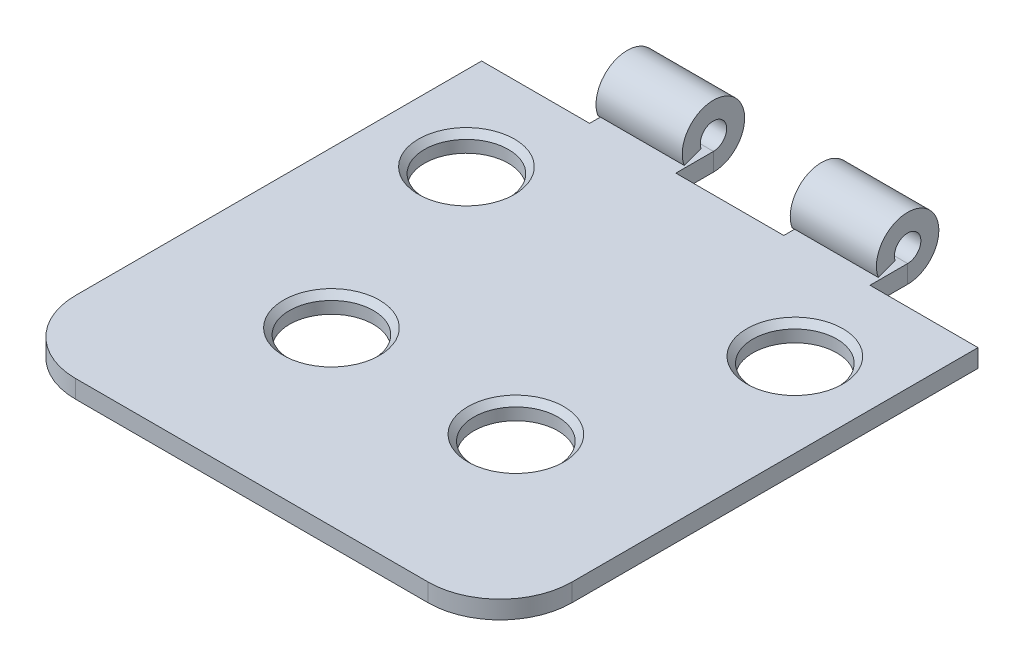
ISO-10303-21;
HEADER;
FILE_DESCRIPTION(('STEP AP214'),'2;1');
FILE_NAME('part.step','',(''),(''),'','','');
FILE_SCHEMA(('AUTOMOTIVE_DESIGN { 1 0 10303 214 1 1 1 1 }'));
ENDSEC;
DATA;
#1=APPLICATION_CONTEXT('core data for automotive mechanical design processes');
#2=APPLICATION_PROTOCOL_DEFINITION('international standard','automotive_design',2000,#1);
#3=PRODUCT_CONTEXT('',#1,'mechanical');
#4=PRODUCT('Part','Part','',(#3));
#5=PRODUCT_RELATED_PRODUCT_CATEGORY('part','',(#4));
#6=PRODUCT_DEFINITION_FORMATION('','',#4);
#7=PRODUCT_DEFINITION_CONTEXT('part definition',#1,'design');
#8=PRODUCT_DEFINITION('design','',#6,#7);
#9=PRODUCT_DEFINITION_SHAPE('','',#8);
#10=(LENGTH_UNIT() NAMED_UNIT(*) SI_UNIT(.MILLI.,.METRE.));
#11=(NAMED_UNIT(*) PLANE_ANGLE_UNIT() SI_UNIT($,.RADIAN.));
#12=(NAMED_UNIT(*) SI_UNIT($,.STERADIAN.) SOLID_ANGLE_UNIT());
#13=UNCERTAINTY_MEASURE_WITH_UNIT(LENGTH_MEASURE(1.E-05),#10,'distance_accuracy_value','');
#14=(GEOMETRIC_REPRESENTATION_CONTEXT(3) GLOBAL_UNCERTAINTY_ASSIGNED_CONTEXT((#13)) GLOBAL_UNIT_ASSIGNED_CONTEXT((#10,
#11,#12)) REPRESENTATION_CONTEXT('',''));
#15=CARTESIAN_POINT('',(0.,0.,0.));
#16=DIRECTION('',(0.,0.,1.));
#17=DIRECTION('',(1.,0.,0.));
#18=AXIS2_PLACEMENT_3D('',#15,#16,#17);
#19=CARTESIAN_POINT('',(9.57949999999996,-0.521709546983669,-5.99830888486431));
#20=DIRECTION('',(0.,1.,0.));
#21=DIRECTION('',(0.,0.,1.));
#22=AXIS2_PLACEMENT_3D('',#19,#20,#21);
#23=CONICAL_SURFACE('',#22,2.45,0.785398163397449);
#24=CARTESIAN_POINT('',(9.57949999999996,-0.171709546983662,-5.99830888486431));
#25=DIRECTION('',(0.,-1.,0.));
#26=DIRECTION('',(0.,0.,-1.));
#27=AXIS2_PLACEMENT_3D('',#24,#25,#26);
#28=CIRCLE('',#27,2.80000000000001);
#29=CARTESIAN_POINT('',(9.57949999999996,-0.171709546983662,-8.79830888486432));
#30=VERTEX_POINT('',#29);
#31=EDGE_CURVE('E276',#30,#30,#28,.T.);
#32=ORIENTED_EDGE('',*,*,#31,.F.);
#33=EDGE_LOOP('',(#32));
#34=FACE_BOUND('',#33,.T.);
#35=CARTESIAN_POINT('',(9.57949999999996,-0.521709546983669,-5.99830888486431));
#36=DIRECTION('',(0.,-1.,0.));
#37=DIRECTION('',(0.,0.,-1.));
#38=AXIS2_PLACEMENT_3D('',#35,#36,#37);
#39=CIRCLE('',#38,2.45);
#40=CARTESIAN_POINT('',(9.57949999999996,-0.521709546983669,-8.44830888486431));
#41=VERTEX_POINT('',#40);
#42=EDGE_CURVE('E354',#41,#41,#39,.F.);
#43=ORIENTED_EDGE('',*,*,#42,.F.);
#44=EDGE_LOOP('',(#43));
#45=FACE_BOUND('',#44,.T.);
#46=ADVANCED_FACE('F54',(#34,#45),#23,.F.);
#47=CARTESIAN_POINT('',(5.37949999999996,-0.521709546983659,6.07683324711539));
#48=DIRECTION('',(0.,1.,0.));
#49=DIRECTION('',(0.,0.,1.));
#50=AXIS2_PLACEMENT_3D('',#47,#48,#49);
#51=CONICAL_SURFACE('',#50,2.45,0.78539816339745);
#52=CARTESIAN_POINT('',(5.37949999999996,-0.171709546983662,6.07683324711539));
#53=DIRECTION('',(0.,-1.,0.));
#54=DIRECTION('',(0.,0.,-1.));
#55=AXIS2_PLACEMENT_3D('',#52,#53,#54);
#56=CIRCLE('',#55,2.8);
#57=CARTESIAN_POINT('',(5.37949999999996,-0.171709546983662,3.27683324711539));
#58=VERTEX_POINT('',#57);
#59=EDGE_CURVE('E279',#58,#58,#56,.T.);
#60=ORIENTED_EDGE('',*,*,#59,.F.);
#61=EDGE_LOOP('',(#60));
#62=FACE_BOUND('',#61,.T.);
#63=CARTESIAN_POINT('',(5.37949999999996,-0.521709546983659,6.07683324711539));
#64=DIRECTION('',(0.,-1.,0.));
#65=DIRECTION('',(0.,0.,-1.));
#66=AXIS2_PLACEMENT_3D('',#63,#64,#65);
#67=CIRCLE('',#66,2.45);
#68=CARTESIAN_POINT('',(5.37949999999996,-0.521709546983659,3.62683324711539));
#69=VERTEX_POINT('',#68);
#70=EDGE_CURVE('E357',#69,#69,#67,.F.);
#71=ORIENTED_EDGE('',*,*,#70,.F.);
#72=EDGE_LOOP('',(#71));
#73=FACE_BOUND('',#72,.T.);
#74=ADVANCED_FACE('F418',(#62,#73),#51,.F.);
#75=CARTESIAN_POINT('',(-5.37950000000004,-0.521709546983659,6.07683324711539));
#76=DIRECTION('',(0.,1.,0.));
#77=DIRECTION('',(0.,0.,1.));
#78=AXIS2_PLACEMENT_3D('',#75,#76,#77);
#79=CONICAL_SURFACE('',#78,2.45,0.78539816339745);
#80=CARTESIAN_POINT('',(-5.37950000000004,-0.171709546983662,6.07683324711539));
#81=DIRECTION('',(0.,-1.,0.));
#82=DIRECTION('',(0.,0.,-1.));
#83=AXIS2_PLACEMENT_3D('',#80,#81,#82);
#84=CIRCLE('',#83,2.8);
#85=CARTESIAN_POINT('',(-5.37950000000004,-0.171709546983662,3.27683324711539));
#86=VERTEX_POINT('',#85);
#87=EDGE_CURVE('E282',#86,#86,#84,.T.);
#88=ORIENTED_EDGE('',*,*,#87,.F.);
#89=EDGE_LOOP('',(#88));
#90=FACE_BOUND('',#89,.T.);
#91=CARTESIAN_POINT('',(-5.37950000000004,-0.521709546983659,6.07683324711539));
#92=DIRECTION('',(0.,-1.,0.));
#93=DIRECTION('',(0.,0.,-1.));
#94=AXIS2_PLACEMENT_3D('',#91,#92,#93);
#95=CIRCLE('',#94,2.45);
#96=CARTESIAN_POINT('',(-5.37950000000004,-0.521709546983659,3.62683324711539));
#97=VERTEX_POINT('',#96);
#98=EDGE_CURVE('E360',#97,#97,#95,.F.);
#99=ORIENTED_EDGE('',*,*,#98,.F.);
#100=EDGE_LOOP('',(#99));
#101=FACE_BOUND('',#100,.T.);
#102=ADVANCED_FACE('F424',(#90,#101),#79,.F.);
#103=CARTESIAN_POINT('',(-9.57950000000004,-0.521709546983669,-5.99830888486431));
#104=DIRECTION('',(0.,1.,0.));
#105=DIRECTION('',(0.,0.,1.));
#106=AXIS2_PLACEMENT_3D('',#103,#104,#105);
#107=CONICAL_SURFACE('',#106,2.45,0.785398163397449);
#108=CARTESIAN_POINT('',(-9.57950000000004,-0.171709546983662,-5.99830888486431));
#109=DIRECTION('',(0.,-1.,0.));
#110=DIRECTION('',(0.,0.,-1.));
#111=AXIS2_PLACEMENT_3D('',#108,#109,#110);
#112=CIRCLE('',#111,2.80000000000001);
#113=CARTESIAN_POINT('',(-9.57950000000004,-0.171709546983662,-8.79830888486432));
#114=VERTEX_POINT('',#113);
#115=EDGE_CURVE('E285',#114,#114,#112,.T.);
#116=ORIENTED_EDGE('',*,*,#115,.F.);
#117=EDGE_LOOP('',(#116));
#118=FACE_BOUND('',#117,.T.);
#119=CARTESIAN_POINT('',(-9.57950000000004,-0.521709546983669,-5.99830888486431));
#120=DIRECTION('',(0.,-1.,0.));
#121=DIRECTION('',(0.,0.,-1.));
#122=AXIS2_PLACEMENT_3D('',#119,#120,#121);
#123=CIRCLE('',#122,2.45);
#124=CARTESIAN_POINT('',(-9.57950000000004,-0.521709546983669,-8.44830888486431));
#125=VERTEX_POINT('',#124);
#126=EDGE_CURVE('E363',#125,#125,#123,.F.);
#127=ORIENTED_EDGE('',*,*,#126,.F.);
#128=EDGE_LOOP('',(#127));
#129=FACE_BOUND('',#128,.T.);
#130=ADVANCED_FACE('F434',(#118,#129),#107,.F.);
#131=CARTESIAN_POINT('',(-9.57950000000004,-1.22170954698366,-5.99830888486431));
#132=DIRECTION('',(0.,1.,0.));
#133=DIRECTION('',(0.,0.,1.));
#134=AXIS2_PLACEMENT_3D('',#131,#132,#133);
#135=CYLINDRICAL_SURFACE('',#134,2.45);
#136=ORIENTED_EDGE('',*,*,#126,.T.);
#137=EDGE_LOOP('',(#136));
#138=FACE_BOUND('',#137,.T.);
#139=CARTESIAN_POINT('',(-9.57950000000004,-1.22170954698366,-5.99830888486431));
#140=DIRECTION('',(0.,1.,0.));
#141=DIRECTION('',(0.,0.,1.));
#142=AXIS2_PLACEMENT_3D('',#139,#140,#141);
#143=CIRCLE('',#142,2.45);
#144=CARTESIAN_POINT('',(-9.57950000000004,-1.22170954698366,-3.54830888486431));
#145=VERTEX_POINT('',#144);
#146=EDGE_CURVE('E294',#145,#145,#143,.T.);
#147=ORIENTED_EDGE('',*,*,#146,.F.);
#148=EDGE_LOOP('',(#147));
#149=FACE_BOUND('',#148,.T.);
#150=ADVANCED_FACE('F438',(#138,#149),#135,.F.);
#151=CARTESIAN_POINT('',(-5.37950000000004,-1.22170954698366,6.07683324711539));
#152=DIRECTION('',(0.,1.,0.));
#153=DIRECTION('',(0.,0.,1.));
#154=AXIS2_PLACEMENT_3D('',#151,#152,#153);
#155=CYLINDRICAL_SURFACE('',#154,2.45);
#156=ORIENTED_EDGE('',*,*,#98,.T.);
#157=EDGE_LOOP('',(#156));
#158=FACE_BOUND('',#157,.T.);
#159=CARTESIAN_POINT('',(-5.37950000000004,-1.22170954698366,6.07683324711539));
#160=DIRECTION('',(0.,1.,0.));
#161=DIRECTION('',(0.,0.,1.));
#162=AXIS2_PLACEMENT_3D('',#159,#160,#161);
#163=CIRCLE('',#162,2.45);
#164=CARTESIAN_POINT('',(-5.37950000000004,-1.22170954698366,8.52683324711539));
#165=VERTEX_POINT('',#164);
#166=EDGE_CURVE('E297',#165,#165,#163,.T.);
#167=ORIENTED_EDGE('',*,*,#166,.F.);
#168=EDGE_LOOP('',(#167));
#169=FACE_BOUND('',#168,.T.);
#170=ADVANCED_FACE('F442',(#158,#169),#155,.F.);
#171=CARTESIAN_POINT('',(5.37949999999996,-1.22170954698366,6.07683324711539));
#172=DIRECTION('',(0.,1.,0.));
#173=DIRECTION('',(0.,0.,1.));
#174=AXIS2_PLACEMENT_3D('',#171,#172,#173);
#175=CYLINDRICAL_SURFACE('',#174,2.45);
#176=ORIENTED_EDGE('',*,*,#70,.T.);
#177=EDGE_LOOP('',(#176));
#178=FACE_BOUND('',#177,.T.);
#179=CARTESIAN_POINT('',(5.37949999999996,-1.22170954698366,6.07683324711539));
#180=DIRECTION('',(0.,1.,0.));
#181=DIRECTION('',(0.,0.,-1.));
#182=AXIS2_PLACEMENT_3D('',#179,#180,#181);
#183=CIRCLE('',#182,2.45);
#184=CARTESIAN_POINT('',(5.37949999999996,-1.22170954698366,3.62683324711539));
#185=VERTEX_POINT('',#184);
#186=EDGE_CURVE('E300',#185,#185,#183,.T.);
#187=ORIENTED_EDGE('',*,*,#186,.F.);
#188=EDGE_LOOP('',(#187));
#189=FACE_BOUND('',#188,.T.);
#190=ADVANCED_FACE('F446',(#178,#189),#175,.F.);
#191=CARTESIAN_POINT('',(9.57949999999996,-1.22170954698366,-5.99830888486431));
#192=DIRECTION('',(0.,1.,0.));
#193=DIRECTION('',(0.,0.,1.));
#194=AXIS2_PLACEMENT_3D('',#191,#192,#193);
#195=CYLINDRICAL_SURFACE('',#194,2.45);
#196=ORIENTED_EDGE('',*,*,#42,.T.);
#197=EDGE_LOOP('',(#196));
#198=FACE_BOUND('',#197,.T.);
#199=CARTESIAN_POINT('',(9.57949999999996,-1.22170954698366,-5.99830888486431));
#200=DIRECTION('',(0.,1.,0.));
#201=DIRECTION('',(0.,0.,-1.));
#202=AXIS2_PLACEMENT_3D('',#199,#200,#201);
#203=CIRCLE('',#202,2.45);
#204=CARTESIAN_POINT('',(9.57949999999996,-1.22170954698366,-8.44830888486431));
#205=VERTEX_POINT('',#204);
#206=EDGE_CURVE('E303',#205,#205,#203,.T.);
#207=ORIENTED_EDGE('',*,*,#206,.F.);
#208=EDGE_LOOP('',(#207));
#209=FACE_BOUND('',#208,.T.);
#210=ADVANCED_FACE('F450',(#198,#209),#195,.F.);
#211=CARTESIAN_POINT('',(-3.15000000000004,-3.67170954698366,-11.7828928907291));
#212=DIRECTION('',(0.,0.,1.));
#213=DIRECTION('',(1.,0.,0.));
#214=AXIS2_PLACEMENT_3D('',#211,#212,#213);
#215=PLANE('',#214);
#216=DIRECTION('',(-1.,0.,0.));
#217=VECTOR('',#216,1.);
#218=CARTESIAN_POINT('',(-10.2795000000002,-1.22170954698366,-11.7828928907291));
#219=LINE('',#218,#217);
#220=CARTESIAN_POINT('',(3.14999999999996,-1.22170954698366,-11.7828928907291));
#221=VERTEX_POINT('',#220);
#222=CARTESIAN_POINT('',(-3.15000000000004,-1.22170954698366,-11.7828928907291));
#223=VERTEX_POINT('',#222);
#224=EDGE_CURVE('E352',#221,#223,#219,.T.);
#225=ORIENTED_EDGE('',*,*,#224,.T.);
#226=DIRECTION('',(0.,1.,0.));
#227=VECTOR('',#226,1.);
#228=CARTESIAN_POINT('',(-3.15000000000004,-3.67170954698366,-11.7828928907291));
#229=LINE('',#228,#227);
#230=CARTESIAN_POINT('',(-3.15000000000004,-0.171709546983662,-11.7828928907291));
#231=VERTEX_POINT('',#230);
#232=EDGE_CURVE('E350',#223,#231,#229,.T.);
#233=ORIENTED_EDGE('',*,*,#232,.T.);
#234=DIRECTION('',(1.,0.,0.));
#235=VECTOR('',#234,1.);
#236=CARTESIAN_POINT('',(-3.15000000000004,-0.171709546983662,-11.7828928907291));
#237=LINE('',#236,#235);
#238=CARTESIAN_POINT('',(3.14999999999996,-0.171709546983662,-11.7828928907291));
#239=VERTEX_POINT('',#238);
#240=EDGE_CURVE('E347',#231,#239,#237,.T.);
#241=ORIENTED_EDGE('',*,*,#240,.T.);
#242=DIRECTION('',(0.,1.,0.));
#243=VECTOR('',#242,1.);
#244=CARTESIAN_POINT('',(3.14999999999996,-3.67170954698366,-11.7828928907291));
#245=LINE('',#244,#243);
#246=EDGE_CURVE('E258',#221,#239,#245,.T.);
#247=ORIENTED_EDGE('',*,*,#246,.F.);
#248=EDGE_LOOP('',(#225,#233,#241,#247));
#249=FACE_BOUND('',#248,.T.);
#250=ADVANCED_FACE('F400',(#249),#215,.F.);
#251=CARTESIAN_POINT('',(-8.17950000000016,-3.67170954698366,-11.7828928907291));
#252=DIRECTION('',(0.,0.,1.));
#253=DIRECTION('',(1.,0.,0.));
#254=AXIS2_PLACEMENT_3D('',#251,#252,#253);
#255=PLANE('',#254);
#256=DIRECTION('',(-1.,0.,0.));
#257=VECTOR('',#256,1.);
#258=CARTESIAN_POINT('',(-10.2795000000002,-1.22170954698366,-11.7828928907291));
#259=LINE('',#258,#257);
#260=CARTESIAN_POINT('',(-8.17950000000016,-1.22170954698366,-11.7828928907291));
#261=VERTEX_POINT('',#260);
#262=CARTESIAN_POINT('',(-14.4795000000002,-1.22170954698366,-11.7828928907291));
#263=VERTEX_POINT('',#262);
#264=EDGE_CURVE('E345',#261,#263,#259,.T.);
#265=ORIENTED_EDGE('',*,*,#264,.T.);
#266=DIRECTION('',(0.,1.,0.));
#267=VECTOR('',#266,1.);
#268=CARTESIAN_POINT('',(-14.4795000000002,-3.67170954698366,-11.7828928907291));
#269=LINE('',#268,#267);
#270=CARTESIAN_POINT('',(-14.4795000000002,-0.171709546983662,-11.7828928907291));
#271=VERTEX_POINT('',#270);
#272=EDGE_CURVE('E343',#263,#271,#269,.T.);
#273=ORIENTED_EDGE('',*,*,#272,.T.);
#274=DIRECTION('',(1.,0.,0.));
#275=VECTOR('',#274,1.);
#276=CARTESIAN_POINT('',(-8.17950000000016,-0.171709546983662,-11.7828928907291));
#277=LINE('',#276,#275);
#278=CARTESIAN_POINT('',(-8.17950000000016,-0.171709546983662,-11.7828928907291));
#279=VERTEX_POINT('',#278);
#280=EDGE_CURVE('E341',#271,#279,#277,.T.);
#281=ORIENTED_EDGE('',*,*,#280,.T.);
#282=DIRECTION('',(0.,1.,0.));
#283=VECTOR('',#282,1.);
#284=CARTESIAN_POINT('',(-8.17950000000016,-3.67170954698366,-11.7828928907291));
#285=LINE('',#284,#283);
#286=EDGE_CURVE('E64',#261,#279,#285,.T.);
#287=ORIENTED_EDGE('',*,*,#286,.F.);
#288=EDGE_LOOP('',(#265,#273,#281,#287));
#289=FACE_BOUND('',#288,.T.);
#290=ADVANCED_FACE('F457',(#289),#255,.F.);
#291=CARTESIAN_POINT('',(-14.4795000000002,-1.22170954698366,11.9006911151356));
#292=DIRECTION('',(-1.,0.,0.));
#293=DIRECTION('',(0.,0.,1.));
#294=AXIS2_PLACEMENT_3D('',#291,#292,#293);
#295=PLANE('',#294);
#296=ORIENTED_EDGE('',*,*,#272,.F.);
#297=DIRECTION('',(0.,0.,1.));
#298=VECTOR('',#297,1.);
#299=CARTESIAN_POINT('',(-14.4795000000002,-1.22170954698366,11.9006911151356));
#300=LINE('',#299,#298);
#301=CARTESIAN_POINT('',(-14.4795000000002,-1.22170954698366,11.9006911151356));
#302=VERTEX_POINT('',#301);
#303=EDGE_CURVE('E339',#263,#302,#300,.T.);
#304=ORIENTED_EDGE('',*,*,#303,.T.);
#305=DIRECTION('',(0.,1.,0.));
#306=VECTOR('',#305,1.);
#307=CARTESIAN_POINT('',(-14.4795000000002,-1.22170954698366,11.9006911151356));
#308=LINE('',#307,#306);
#309=CARTESIAN_POINT('',(-14.4795000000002,-0.171709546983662,11.9006911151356));
#310=VERTEX_POINT('',#309);
#311=EDGE_CURVE('E336',#302,#310,#308,.T.);
#312=ORIENTED_EDGE('',*,*,#311,.T.);
#313=DIRECTION('',(0.,0.,1.));
#314=VECTOR('',#313,1.);
#315=CARTESIAN_POINT('',(-14.4795000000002,-0.171709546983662,11.9006911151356));
#316=LINE('',#315,#314);
#317=EDGE_CURVE('E271',#271,#310,#316,.T.);
#318=ORIENTED_EDGE('',*,*,#317,.F.);
#319=EDGE_LOOP('',(#296,#304,#312,#318));
#320=FACE_BOUND('',#319,.T.);
#321=ADVANCED_FACE('F460',(#320),#295,.T.);
#322=CARTESIAN_POINT('',(-10.2795000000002,-1.22170954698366,11.9006911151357));
#323=DIRECTION('',(0.,1.,0.));
#324=DIRECTION('',(0.,0.,1.));
#325=AXIS2_PLACEMENT_3D('',#322,#323,#324);
#326=CYLINDRICAL_SURFACE('',#325,4.2);
#327=CARTESIAN_POINT('',(-10.2795000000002,-0.171709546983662,11.9006911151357));
#328=DIRECTION('',(0.,1.,0.));
#329=DIRECTION('',(0.,0.,-1.));
#330=AXIS2_PLACEMENT_3D('',#327,#328,#329);
#331=CIRCLE('',#330,4.2);
#332=CARTESIAN_POINT('',(-10.2795000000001,-0.171709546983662,16.1006911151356));
#333=VERTEX_POINT('',#332);
#334=EDGE_CURVE('E268',#310,#333,#331,.T.);
#335=ORIENTED_EDGE('',*,*,#334,.F.);
#336=ORIENTED_EDGE('',*,*,#311,.F.);
#337=CARTESIAN_POINT('',(-10.2795000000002,-1.22170954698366,11.9006911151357));
#338=DIRECTION('',(0.,1.,0.));
#339=DIRECTION('',(0.,0.,-1.));
#340=AXIS2_PLACEMENT_3D('',#337,#338,#339);
#341=CIRCLE('',#340,4.2);
#342=CARTESIAN_POINT('',(-10.2795000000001,-1.22170954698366,16.1006911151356));
#343=VERTEX_POINT('',#342);
#344=EDGE_CURVE('E333',#302,#343,#341,.T.);
#345=ORIENTED_EDGE('',*,*,#344,.T.);
#346=DIRECTION('',(0.,1.,0.));
#347=VECTOR('',#346,1.);
#348=CARTESIAN_POINT('',(-10.2795000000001,-1.22170954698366,16.1006911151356));
#349=LINE('',#348,#347);
#350=EDGE_CURVE('E331',#343,#333,#349,.T.);
#351=ORIENTED_EDGE('',*,*,#350,.T.);
#352=EDGE_LOOP('',(#335,#336,#345,#351));
#353=FACE_BOUND('',#352,.T.);
#354=ADVANCED_FACE('F464',(#353),#326,.T.);
#355=CARTESIAN_POINT('',(-10.2795000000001,-1.22170954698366,16.1006911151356));
#356=DIRECTION('',(0.,0.,1.));
#357=DIRECTION('',(1.,0.,0.));
#358=AXIS2_PLACEMENT_3D('',#355,#356,#357);
#359=PLANE('',#358);
#360=DIRECTION('',(1.,0.,0.));
#361=VECTOR('',#360,1.);
#362=CARTESIAN_POINT('',(-10.2795000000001,-0.171709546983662,16.1006911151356));
#363=LINE('',#362,#361);
#364=CARTESIAN_POINT('',(10.2794999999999,-0.171709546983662,16.1006911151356));
#365=VERTEX_POINT('',#364);
#366=EDGE_CURVE('E265',#333,#365,#363,.T.);
#367=ORIENTED_EDGE('',*,*,#366,.F.);
#368=ORIENTED_EDGE('',*,*,#350,.F.);
#369=DIRECTION('',(1.,0.,0.));
#370=VECTOR('',#369,1.);
#371=CARTESIAN_POINT('',(-10.2795000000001,-1.22170954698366,16.1006911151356));
#372=LINE('',#371,#370);
#373=CARTESIAN_POINT('',(10.2794999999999,-1.22170954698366,16.1006911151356));
#374=VERTEX_POINT('',#373);
#375=EDGE_CURVE('E328',#343,#374,#372,.T.);
#376=ORIENTED_EDGE('',*,*,#375,.T.);
#377=DIRECTION('',(0.,1.,0.));
#378=VECTOR('',#377,1.);
#379=CARTESIAN_POINT('',(10.2794999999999,-1.22170954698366,16.1006911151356));
#380=LINE('',#379,#378);
#381=EDGE_CURVE('E326',#374,#365,#380,.T.);
#382=ORIENTED_EDGE('',*,*,#381,.T.);
#383=EDGE_LOOP('',(#367,#368,#376,#382));
#384=FACE_BOUND('',#383,.T.);
#385=ADVANCED_FACE('F468',(#384),#359,.T.);
#386=CARTESIAN_POINT('',(10.2794999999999,-1.22170954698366,11.9006911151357));
#387=DIRECTION('',(0.,1.,0.));
#388=DIRECTION('',(0.,0.,1.));
#389=AXIS2_PLACEMENT_3D('',#386,#387,#388);
#390=CYLINDRICAL_SURFACE('',#389,4.2);
#391=CARTESIAN_POINT('',(10.2794999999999,-0.171709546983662,11.9006911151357));
#392=DIRECTION('',(0.,1.,0.));
#393=DIRECTION('',(0.,0.,1.));
#394=AXIS2_PLACEMENT_3D('',#391,#392,#393);
#395=CIRCLE('',#394,4.2);
#396=CARTESIAN_POINT('',(14.4794999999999,-0.171709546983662,11.9006911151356));
#397=VERTEX_POINT('',#396);
#398=EDGE_CURVE('E262',#365,#397,#395,.T.);
#399=ORIENTED_EDGE('',*,*,#398,.F.);
#400=ORIENTED_EDGE('',*,*,#381,.F.);
#401=CARTESIAN_POINT('',(10.2794999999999,-1.22170954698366,11.9006911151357));
#402=DIRECTION('',(0.,1.,0.));
#403=DIRECTION('',(0.,0.,1.));
#404=AXIS2_PLACEMENT_3D('',#401,#402,#403);
#405=CIRCLE('',#404,4.2);
#406=CARTESIAN_POINT('',(14.4794999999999,-1.22170954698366,11.9006911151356));
#407=VERTEX_POINT('',#406);
#408=EDGE_CURVE('E323',#374,#407,#405,.T.);
#409=ORIENTED_EDGE('',*,*,#408,.T.);
#410=DIRECTION('',(0.,1.,0.));
#411=VECTOR('',#410,1.);
#412=CARTESIAN_POINT('',(14.4794999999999,-1.22170954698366,11.9006911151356));
#413=LINE('',#412,#411);
#414=EDGE_CURVE('E321',#407,#397,#413,.T.);
#415=ORIENTED_EDGE('',*,*,#414,.T.);
#416=EDGE_LOOP('',(#399,#400,#409,#415));
#417=FACE_BOUND('',#416,.T.);
#418=ADVANCED_FACE('F472',(#417),#390,.T.);
#419=CARTESIAN_POINT('',(14.4794999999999,-1.22170954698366,11.9006911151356));
#420=DIRECTION('',(1.,0.,0.));
#421=DIRECTION('',(0.,0.,-1.));
#422=AXIS2_PLACEMENT_3D('',#419,#420,#421);
#423=PLANE('',#422);
#424=DIRECTION('',(0.,1.,0.));
#425=VECTOR('',#424,1.);
#426=CARTESIAN_POINT('',(14.4794999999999,-3.67170954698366,-11.7828928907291));
#427=LINE('',#426,#425);
#428=CARTESIAN_POINT('',(14.4794999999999,-1.22170954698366,-11.7828928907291));
#429=VERTEX_POINT('',#428);
#430=CARTESIAN_POINT('',(14.4794999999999,-0.171709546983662,-11.7828928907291));
#431=VERTEX_POINT('',#430);
#432=EDGE_CURVE('E318',#429,#431,#427,.T.);
#433=ORIENTED_EDGE('',*,*,#432,.T.);
#434=DIRECTION('',(0.,0.,-1.));
#435=VECTOR('',#434,1.);
#436=CARTESIAN_POINT('',(14.4794999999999,-0.171709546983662,11.9006911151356));
#437=LINE('',#436,#435);
#438=EDGE_CURVE('E273',#397,#431,#437,.T.);
#439=ORIENTED_EDGE('',*,*,#438,.F.);
#440=ORIENTED_EDGE('',*,*,#414,.F.);
#441=DIRECTION('',(0.,0.,-1.));
#442=VECTOR('',#441,1.);
#443=CARTESIAN_POINT('',(14.4794999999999,-1.22170954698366,11.9006911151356));
#444=LINE('',#443,#442);
#445=EDGE_CURVE('E315',#407,#429,#444,.T.);
#446=ORIENTED_EDGE('',*,*,#445,.T.);
#447=EDGE_LOOP('',(#433,#439,#440,#446));
#448=FACE_BOUND('',#447,.T.);
#449=ADVANCED_FACE('F476',(#448),#423,.T.);
#450=CARTESIAN_POINT('',(14.4794999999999,-3.67170954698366,-11.7828928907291));
#451=DIRECTION('',(0.,0.,1.));
#452=DIRECTION('',(1.,0.,0.));
#453=AXIS2_PLACEMENT_3D('',#450,#451,#452);
#454=PLANE('',#453);
#455=DIRECTION('',(-1.,0.,0.));
#456=VECTOR('',#455,1.);
#457=CARTESIAN_POINT('',(-10.2795000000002,-1.22170954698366,-11.7828928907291));
#458=LINE('',#457,#456);
#459=CARTESIAN_POINT('',(8.17949999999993,-1.22170954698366,-11.7828928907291));
#460=VERTEX_POINT('',#459);
#461=EDGE_CURVE('E313',#429,#460,#458,.T.);
#462=ORIENTED_EDGE('',*,*,#461,.T.);
#463=DIRECTION('',(0.,1.,0.));
#464=VECTOR('',#463,1.);
#465=CARTESIAN_POINT('',(8.17949999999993,-3.67170954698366,-11.7828928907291));
#466=LINE('',#465,#464);
#467=CARTESIAN_POINT('',(8.17949999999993,-0.171709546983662,-11.7828928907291));
#468=VERTEX_POINT('',#467);
#469=EDGE_CURVE('E311',#460,#468,#466,.T.);
#470=ORIENTED_EDGE('',*,*,#469,.T.);
#471=DIRECTION('',(1.,0.,0.));
#472=VECTOR('',#471,1.);
#473=CARTESIAN_POINT('',(14.4794999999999,-0.171709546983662,-11.7828928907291));
#474=LINE('',#473,#472);
#475=EDGE_CURVE('E309',#468,#431,#474,.T.);
#476=ORIENTED_EDGE('',*,*,#475,.T.);
#477=ORIENTED_EDGE('',*,*,#432,.F.);
#478=EDGE_LOOP('',(#462,#470,#476,#477));
#479=FACE_BOUND('',#478,.T.);
#480=ADVANCED_FACE('F480',(#479),#454,.F.);
#481=CARTESIAN_POINT('',(-10.2795000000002,-1.22170954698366,11.9006911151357));
#482=DIRECTION('',(0.,-1.,0.));
#483=DIRECTION('',(0.,0.,-1.));
#484=AXIS2_PLACEMENT_3D('',#481,#482,#483);
#485=PLANE('',#484);
#486=ORIENTED_EDGE('',*,*,#461,.F.);
#487=ORIENTED_EDGE('',*,*,#445,.F.);
#488=ORIENTED_EDGE('',*,*,#408,.F.);
#489=ORIENTED_EDGE('',*,*,#375,.F.);
#490=ORIENTED_EDGE('',*,*,#344,.F.);
#491=ORIENTED_EDGE('',*,*,#303,.F.);
#492=ORIENTED_EDGE('',*,*,#264,.F.);
#493=DIRECTION('',(0.,0.,1.));
#494=VECTOR('',#493,1.);
#495=CARTESIAN_POINT('',(-8.17950000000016,-1.22170954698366,11.9006911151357));
#496=LINE('',#495,#494);
#497=CARTESIAN_POINT('',(-8.17950000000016,-1.22170954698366,-13.9783088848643));
#498=VERTEX_POINT('',#497);
#499=EDGE_CURVE('E152',#498,#261,#496,.T.);
#500=ORIENTED_EDGE('',*,*,#499,.F.);
#501=DIRECTION('',(1.,0.,0.));
#502=VECTOR('',#501,1.);
#503=CARTESIAN_POINT('',(-14.4795000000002,-1.22170954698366,-13.9783088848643));
#504=LINE('',#503,#502);
#505=CARTESIAN_POINT('',(-3.15000000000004,-1.22170954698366,-13.9783088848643));
#506=VERTEX_POINT('',#505);
#507=EDGE_CURVE('E157',#498,#506,#504,.T.);
#508=ORIENTED_EDGE('',*,*,#507,.T.);
#509=DIRECTION('',(0.,0.,-1.));
#510=VECTOR('',#509,1.);
#511=CARTESIAN_POINT('',(-3.15000000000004,-1.22170954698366,11.9006911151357));
#512=LINE('',#511,#510);
#513=EDGE_CURVE('E251',#223,#506,#512,.T.);
#514=ORIENTED_EDGE('',*,*,#513,.F.);
#515=ORIENTED_EDGE('',*,*,#224,.F.);
#516=DIRECTION('',(0.,0.,1.));
#517=VECTOR('',#516,1.);
#518=CARTESIAN_POINT('',(3.14999999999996,-1.22170954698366,11.9006911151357));
#519=LINE('',#518,#517);
#520=CARTESIAN_POINT('',(3.14999999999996,-1.22170954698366,-13.9783088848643));
#521=VERTEX_POINT('',#520);
#522=EDGE_CURVE('E260',#521,#221,#519,.T.);
#523=ORIENTED_EDGE('',*,*,#522,.F.);
#524=DIRECTION('',(1.,0.,0.));
#525=VECTOR('',#524,1.);
#526=CARTESIAN_POINT('',(-14.4795000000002,-1.22170954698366,-13.9783088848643));
#527=LINE('',#526,#525);
#528=CARTESIAN_POINT('',(8.17949999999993,-1.22170954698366,-13.9783088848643));
#529=VERTEX_POINT('',#528);
#530=EDGE_CURVE('E306',#521,#529,#527,.T.);
#531=ORIENTED_EDGE('',*,*,#530,.T.);
#532=DIRECTION('',(0.,0.,-1.));
#533=VECTOR('',#532,1.);
#534=CARTESIAN_POINT('',(8.17949999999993,-1.22170954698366,11.9006911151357));
#535=LINE('',#534,#533);
#536=EDGE_CURVE('E288',#460,#529,#535,.T.);
#537=ORIENTED_EDGE('',*,*,#536,.F.);
#538=EDGE_LOOP('',(#486,#487,#488,#489,#490,#491,#492,#500,#508,#514,#515,#523,#531,#537));
#539=FACE_BOUND('',#538,.T.);
#540=ORIENTED_EDGE('',*,*,#206,.T.);
#541=EDGE_LOOP('',(#540));
#542=FACE_BOUND('',#541,.T.);
#543=ORIENTED_EDGE('',*,*,#186,.T.);
#544=EDGE_LOOP('',(#543));
#545=FACE_BOUND('',#544,.T.);
#546=ORIENTED_EDGE('',*,*,#166,.T.);
#547=EDGE_LOOP('',(#546));
#548=FACE_BOUND('',#547,.T.);
#549=ORIENTED_EDGE('',*,*,#146,.T.);
#550=EDGE_LOOP('',(#549));
#551=FACE_BOUND('',#550,.T.);
#552=ADVANCED_FACE('F395',(#539,#542,#545,#548,#551),#485,.T.);
#553=CARTESIAN_POINT('',(8.17949999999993,-3.67170954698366,-20.5328928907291));
#554=DIRECTION('',(-1.,0.,0.));
#555=DIRECTION('',(0.,0.,1.));
#556=AXIS2_PLACEMENT_3D('',#553,#554,#555);
#557=PLANE('',#556);
#558=DIRECTION('',(0.,-1.,0.));
#559=VECTOR('',#558,1.);
#560=CARTESIAN_POINT('',(8.17949999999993,-0.171709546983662,-13.9783088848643));
#561=LINE('',#560,#559);
#562=CARTESIAN_POINT('',(8.17949999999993,-0.171709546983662,-13.9783088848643));
#563=VERTEX_POINT('',#562);
#564=EDGE_CURVE('E217',#563,#529,#561,.T.);
#565=ORIENTED_EDGE('',*,*,#564,.F.);
#566=DIRECTION('',(0.,0.,1.));
#567=VECTOR('',#566,1.);
#568=CARTESIAN_POINT('',(8.17949999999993,-0.171709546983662,-20.5328928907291));
#569=LINE('',#568,#567);
#570=EDGE_CURVE('E291',#563,#468,#569,.T.);
#571=ORIENTED_EDGE('',*,*,#570,.T.);
#572=ORIENTED_EDGE('',*,*,#469,.F.);
#573=ORIENTED_EDGE('',*,*,#536,.T.);
#574=EDGE_LOOP('',(#565,#571,#572,#573));
#575=FACE_BOUND('',#574,.T.);
#576=ADVANCED_FACE('F487',(#575),#557,.F.);
#577=CARTESIAN_POINT('',(-10.2795000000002,-0.171709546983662,11.9006911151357));
#578=DIRECTION('',(0.,-1.,0.));
#579=DIRECTION('',(0.,0.,-1.));
#580=AXIS2_PLACEMENT_3D('',#577,#578,#579);
#581=PLANE('',#580);
#582=ORIENTED_EDGE('',*,*,#115,.T.);
#583=EDGE_LOOP('',(#582));
#584=FACE_BOUND('',#583,.T.);
#585=ORIENTED_EDGE('',*,*,#87,.T.);
#586=EDGE_LOOP('',(#585));
#587=FACE_BOUND('',#586,.T.);
#588=ORIENTED_EDGE('',*,*,#59,.T.);
#589=EDGE_LOOP('',(#588));
#590=FACE_BOUND('',#589,.T.);
#591=ORIENTED_EDGE('',*,*,#31,.T.);
#592=EDGE_LOOP('',(#591));
#593=FACE_BOUND('',#592,.T.);
#594=ORIENTED_EDGE('',*,*,#438,.T.);
#595=ORIENTED_EDGE('',*,*,#475,.F.);
#596=ORIENTED_EDGE('',*,*,#570,.F.);
#597=DIRECTION('',(1.,0.,0.));
#598=VECTOR('',#597,1.);
#599=CARTESIAN_POINT('',(-14.4795000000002,-0.171709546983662,-13.9783088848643));
#600=LINE('',#599,#598);
#601=CARTESIAN_POINT('',(3.14999999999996,-0.171709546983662,-13.9783088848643));
#602=VERTEX_POINT('',#601);
#603=EDGE_CURVE('E367',#602,#563,#600,.T.);
#604=ORIENTED_EDGE('',*,*,#603,.F.);
#605=DIRECTION('',(0.,0.,-1.));
#606=VECTOR('',#605,1.);
#607=CARTESIAN_POINT('',(3.14999999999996,-0.171709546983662,-11.7828928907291));
#608=LINE('',#607,#606);
#609=EDGE_CURVE('E256',#239,#602,#608,.T.);
#610=ORIENTED_EDGE('',*,*,#609,.F.);
#611=ORIENTED_EDGE('',*,*,#240,.F.);
#612=DIRECTION('',(0.,0.,1.));
#613=VECTOR('',#612,1.);
#614=CARTESIAN_POINT('',(-3.15000000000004,-0.171709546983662,-11.7828928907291));
#615=LINE('',#614,#613);
#616=CARTESIAN_POINT('',(-3.15000000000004,-0.171709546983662,-13.9783088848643));
#617=VERTEX_POINT('',#616);
#618=EDGE_CURVE('E253',#617,#231,#615,.T.);
#619=ORIENTED_EDGE('',*,*,#618,.F.);
#620=DIRECTION('',(1.,0.,0.));
#621=VECTOR('',#620,1.);
#622=CARTESIAN_POINT('',(-14.4795000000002,-0.171709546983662,-13.9783088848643));
#623=LINE('',#622,#621);
#624=CARTESIAN_POINT('',(-8.17950000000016,-0.171709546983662,-13.9783088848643));
#625=VERTEX_POINT('',#624);
#626=EDGE_CURVE('E375',#625,#617,#623,.T.);
#627=ORIENTED_EDGE('',*,*,#626,.F.);
#628=DIRECTION('',(0.,0.,-1.));
#629=VECTOR('',#628,1.);
#630=CARTESIAN_POINT('',(-8.17950000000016,-0.171709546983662,-20.5328928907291));
#631=LINE('',#630,#629);
#632=EDGE_CURVE('E12',#279,#625,#631,.T.);
#633=ORIENTED_EDGE('',*,*,#632,.F.);
#634=ORIENTED_EDGE('',*,*,#280,.F.);
#635=ORIENTED_EDGE('',*,*,#317,.T.);
#636=ORIENTED_EDGE('',*,*,#334,.T.);
#637=ORIENTED_EDGE('',*,*,#366,.T.);
#638=ORIENTED_EDGE('',*,*,#398,.T.);
#639=EDGE_LOOP('',(#594,#595,#596,#604,#610,#611,#619,#627,#633,#634,#635,#636,#637,#638));
#640=FACE_BOUND('',#639,.T.);
#641=ADVANCED_FACE('F490',(#584,#587,#590,#593,#640),#581,.F.);
#642=CARTESIAN_POINT('',(3.14999999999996,-3.67170954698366,-11.7828928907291));
#643=DIRECTION('',(1.,0.,0.));
#644=DIRECTION('',(0.,0.,-1.));
#645=AXIS2_PLACEMENT_3D('',#642,#643,#644);
#646=PLANE('',#645);
#647=DIRECTION('',(0.,1.,0.));
#648=VECTOR('',#647,1.);
#649=CARTESIAN_POINT('',(3.14999999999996,-1.22170954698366,-13.9783088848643));
#650=LINE('',#649,#648);
#651=EDGE_CURVE('E370',#521,#602,#650,.T.);
#652=ORIENTED_EDGE('',*,*,#651,.F.);
#653=ORIENTED_EDGE('',*,*,#522,.T.);
#654=ORIENTED_EDGE('',*,*,#246,.T.);
#655=ORIENTED_EDGE('',*,*,#609,.T.);
#656=EDGE_LOOP('',(#652,#653,#654,#655));
#657=FACE_BOUND('',#656,.T.);
#658=ADVANCED_FACE('F403',(#657),#646,.F.);
#659=CARTESIAN_POINT('',(-3.15000000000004,-3.67170954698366,-11.7828928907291));
#660=DIRECTION('',(-1.,0.,0.));
#661=DIRECTION('',(0.,0.,1.));
#662=AXIS2_PLACEMENT_3D('',#659,#660,#661);
#663=PLANE('',#662);
#664=DIRECTION('',(0.,-1.,0.));
#665=VECTOR('',#664,1.);
#666=CARTESIAN_POINT('',(-3.15000000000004,-0.171709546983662,-13.9783088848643));
#667=LINE('',#666,#665);
#668=EDGE_CURVE('E373',#617,#506,#667,.T.);
#669=ORIENTED_EDGE('',*,*,#668,.F.);
#670=ORIENTED_EDGE('',*,*,#618,.T.);
#671=ORIENTED_EDGE('',*,*,#232,.F.);
#672=ORIENTED_EDGE('',*,*,#513,.T.);
#673=EDGE_LOOP('',(#669,#670,#671,#672));
#674=FACE_BOUND('',#673,.T.);
#675=ADVANCED_FACE('F390',(#674),#663,.F.);
#676=CARTESIAN_POINT('',(-8.17950000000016,-3.67170954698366,-20.5328928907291));
#677=DIRECTION('',(1.,0.,0.));
#678=DIRECTION('',(0.,0.,-1.));
#679=AXIS2_PLACEMENT_3D('',#676,#677,#678);
#680=PLANE('',#679);
#681=DIRECTION('',(0.,1.,0.));
#682=VECTOR('',#681,1.);
#683=CARTESIAN_POINT('',(-8.17950000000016,-1.22170954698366,-13.9783088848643));
#684=LINE('',#683,#682);
#685=EDGE_CURVE('E58',#498,#625,#684,.T.);
#686=ORIENTED_EDGE('',*,*,#685,.F.);
#687=ORIENTED_EDGE('',*,*,#499,.T.);
#688=ORIENTED_EDGE('',*,*,#286,.T.);
#689=ORIENTED_EDGE('',*,*,#632,.T.);
#690=EDGE_LOOP('',(#686,#687,#688,#689));
#691=FACE_BOUND('',#690,.T.);
#692=ADVANCED_FACE('F56',(#691),#680,.F.);
#693=CARTESIAN_POINT('',(-8.17950000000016,0.598290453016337,-13.9783088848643));
#694=DIRECTION('',(-1.,0.,0.));
#695=DIRECTION('',(0.,0.,1.));
#696=AXIS2_PLACEMENT_3D('',#693,#694,#695);
#697=PLANE('',#696);
#698=ORIENTED_EDGE('',*,*,#685,.T.);
#699=CARTESIAN_POINT('',(-8.17950000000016,0.598290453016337,-13.9783088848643));
#700=DIRECTION('',(1.,0.,0.));
#701=DIRECTION('',(0.,0.,-1.));
#702=AXIS2_PLACEMENT_3D('',#699,#700,#701);
#703=CIRCLE('',#702,0.77);
#704=CARTESIAN_POINT('',(-8.17950000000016,0.334934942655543,-13.2547455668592));
#705=VERTEX_POINT('',#704);
#706=EDGE_CURVE('E210',#625,#705,#703,.T.);
#707=ORIENTED_EDGE('',*,*,#706,.T.);
#708=DIRECTION('',(0.,-0.342020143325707,0.939692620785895));
#709=VECTOR('',#708,1.);
#710=CARTESIAN_POINT('',(-8.17950000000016,-0.0241862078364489,-12.268068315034));
#711=LINE('',#710,#709);
#712=CARTESIAN_POINT('',(-8.17950000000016,-0.0241862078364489,-12.268068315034));
#713=VERTEX_POINT('',#712);
#714=EDGE_CURVE('E176',#705,#713,#711,.T.);
#715=ORIENTED_EDGE('',*,*,#714,.T.);
#716=CARTESIAN_POINT('',(-8.17950000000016,0.598290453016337,-13.9783088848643));
#717=DIRECTION('',(1.,0.,0.));
#718=DIRECTION('',(0.,0.,-1.));
#719=AXIS2_PLACEMENT_3D('',#716,#717,#718);
#720=CIRCLE('',#719,1.82);
#721=EDGE_CURVE('E232',#498,#713,#720,.T.);
#722=ORIENTED_EDGE('',*,*,#721,.F.);
#723=EDGE_LOOP('',(#698,#707,#715,#722));
#724=FACE_BOUND('',#723,.T.);
#725=ADVANCED_FACE('F382',(#724),#697,.T.);
#726=CARTESIAN_POINT('',(-5.6647500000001,-0.0241862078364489,-12.268068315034));
#727=DIRECTION('',(0.,-0.939692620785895,-0.342020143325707));
#728=DIRECTION('',(1.,0.,0.));
#729=AXIS2_PLACEMENT_3D('',#726,#727,#728);
#730=PLANE('',#729);
#731=ORIENTED_EDGE('',*,*,#714,.F.);
#732=DIRECTION('',(1.,0.,0.));
#733=VECTOR('',#732,1.);
#734=CARTESIAN_POINT('',(-13.9930716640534,0.334934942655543,-13.2547455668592));
#735=LINE('',#734,#733);
#736=CARTESIAN_POINT('',(-3.15000000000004,0.334934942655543,-13.2547455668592));
#737=VERTEX_POINT('',#736);
#738=EDGE_CURVE('E243',#705,#737,#735,.T.);
#739=ORIENTED_EDGE('',*,*,#738,.T.);
#740=DIRECTION('',(0.,-0.342020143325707,0.939692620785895));
#741=VECTOR('',#740,1.);
#742=CARTESIAN_POINT('',(-3.15000000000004,-0.0241862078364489,-12.268068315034));
#743=LINE('',#742,#741);
#744=CARTESIAN_POINT('',(-3.15000000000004,-0.0241862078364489,-12.268068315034));
#745=VERTEX_POINT('',#744);
#746=EDGE_CURVE('E168',#737,#745,#743,.T.);
#747=ORIENTED_EDGE('',*,*,#746,.T.);
#748=DIRECTION('',(1.,0.,0.));
#749=VECTOR('',#748,1.);
#750=CARTESIAN_POINT('',(-8.17950000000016,-0.0241862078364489,-12.268068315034));
#751=LINE('',#750,#749);
#752=EDGE_CURVE('E235',#713,#745,#751,.T.);
#753=ORIENTED_EDGE('',*,*,#752,.F.);
#754=EDGE_LOOP('',(#731,#739,#747,#753));
#755=FACE_BOUND('',#754,.T.);
#756=ADVANCED_FACE('F384',(#755),#730,.T.);
#757=CARTESIAN_POINT('',(-3.15000000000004,0.598290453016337,-13.9783088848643));
#758=DIRECTION('',(1.,0.,0.));
#759=DIRECTION('',(0.,0.,-1.));
#760=AXIS2_PLACEMENT_3D('',#757,#758,#759);
#761=PLANE('',#760);
#762=ORIENTED_EDGE('',*,*,#746,.F.);
#763=CARTESIAN_POINT('',(-3.15000000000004,0.598290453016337,-13.9783088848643));
#764=DIRECTION('',(1.,0.,0.));
#765=DIRECTION('',(0.,0.,-1.));
#766=AXIS2_PLACEMENT_3D('',#763,#764,#765);
#767=CIRCLE('',#766,0.77);
#768=EDGE_CURVE('E236',#737,#617,#767,.F.);
#769=ORIENTED_EDGE('',*,*,#768,.T.);
#770=ORIENTED_EDGE('',*,*,#668,.T.);
#771=CARTESIAN_POINT('',(-3.15000000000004,0.598290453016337,-13.9783088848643));
#772=DIRECTION('',(-1.,0.,0.));
#773=DIRECTION('',(0.,0.,1.));
#774=AXIS2_PLACEMENT_3D('',#771,#772,#773);
#775=CIRCLE('',#774,1.82);
#776=EDGE_CURVE('E239',#745,#506,#775,.T.);
#777=ORIENTED_EDGE('',*,*,#776,.F.);
#778=EDGE_LOOP('',(#762,#769,#770,#777));
#779=FACE_BOUND('',#778,.T.);
#780=ADVANCED_FACE('F387',(#779),#761,.T.);
#781=CARTESIAN_POINT('',(-13.9930716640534,0.598290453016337,-13.9783088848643));
#782=DIRECTION('',(1.,0.,0.));
#783=DIRECTION('',(0.,0.,-1.));
#784=AXIS2_PLACEMENT_3D('',#781,#782,#783);
#785=CYLINDRICAL_SURFACE('',#784,1.82);
#786=ORIENTED_EDGE('',*,*,#776,.T.);
#787=ORIENTED_EDGE('',*,*,#507,.F.);
#788=ORIENTED_EDGE('',*,*,#721,.T.);
#789=ORIENTED_EDGE('',*,*,#752,.T.);
#790=EDGE_LOOP('',(#786,#787,#788,#789));
#791=FACE_BOUND('',#790,.T.);
#792=ADVANCED_FACE('F386',(#791),#785,.T.);
#793=CARTESIAN_POINT('',(-13.9930716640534,0.598290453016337,-13.9783088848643));
#794=DIRECTION('',(1.,0.,0.));
#795=DIRECTION('',(0.,0.,-1.));
#796=AXIS2_PLACEMENT_3D('',#793,#794,#795);
#797=CYLINDRICAL_SURFACE('',#796,0.77);
#798=ORIENTED_EDGE('',*,*,#768,.F.);
#799=ORIENTED_EDGE('',*,*,#738,.F.);
#800=ORIENTED_EDGE('',*,*,#706,.F.);
#801=ORIENTED_EDGE('',*,*,#626,.T.);
#802=EDGE_LOOP('',(#798,#799,#800,#801));
#803=FACE_BOUND('',#802,.T.);
#804=ADVANCED_FACE('F383',(#803),#797,.F.);
#805=CARTESIAN_POINT('',(8.17949999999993,0.598290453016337,-13.9783088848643));
#806=DIRECTION('',(1.,0.,0.));
#807=DIRECTION('',(0.,0.,-1.));
#808=AXIS2_PLACEMENT_3D('',#805,#806,#807);
#809=PLANE('',#808);
#810=DIRECTION('',(0.,-0.342020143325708,0.939692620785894));
#811=VECTOR('',#810,1.);
#812=CARTESIAN_POINT('',(8.17949999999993,-0.0241862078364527,-12.268068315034));
#813=LINE('',#812,#811);
#814=CARTESIAN_POINT('',(8.17949999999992,0.334934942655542,-13.2547455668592));
#815=VERTEX_POINT('',#814);
#816=CARTESIAN_POINT('',(8.17949999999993,-0.0241862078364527,-12.268068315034));
#817=VERTEX_POINT('',#816);
#818=EDGE_CURVE('E200',#815,#817,#813,.T.);
#819=ORIENTED_EDGE('',*,*,#818,.F.);
#820=CARTESIAN_POINT('',(8.17949999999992,0.598290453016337,-13.9783088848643));
#821=DIRECTION('',(1.,0.,0.));
#822=DIRECTION('',(0.,0.,-1.));
#823=AXIS2_PLACEMENT_3D('',#820,#821,#822);
#824=CIRCLE('',#823,0.77);
#825=EDGE_CURVE('E229',#815,#563,#824,.F.);
#826=ORIENTED_EDGE('',*,*,#825,.T.);
#827=ORIENTED_EDGE('',*,*,#564,.T.);
#828=CARTESIAN_POINT('',(8.17949999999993,0.598290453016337,-13.9783088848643));
#829=DIRECTION('',(-1.,0.,0.));
#830=DIRECTION('',(0.,0.,1.));
#831=AXIS2_PLACEMENT_3D('',#828,#829,#830);
#832=CIRCLE('',#831,1.82);
#833=EDGE_CURVE('E214',#817,#529,#832,.T.);
#834=ORIENTED_EDGE('',*,*,#833,.F.);
#835=EDGE_LOOP('',(#819,#826,#827,#834));
#836=FACE_BOUND('',#835,.T.);
#837=ADVANCED_FACE('F215',(#836),#809,.T.);
#838=CARTESIAN_POINT('',(3.14999999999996,0.598290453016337,-13.9783088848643));
#839=DIRECTION('',(-1.,0.,0.));
#840=DIRECTION('',(0.,0.,1.));
#841=AXIS2_PLACEMENT_3D('',#838,#839,#840);
#842=PLANE('',#841);
#843=ORIENTED_EDGE('',*,*,#651,.T.);
#844=CARTESIAN_POINT('',(3.14999999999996,0.598290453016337,-13.9783088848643));
#845=DIRECTION('',(1.,0.,0.));
#846=DIRECTION('',(0.,0.,-1.));
#847=AXIS2_PLACEMENT_3D('',#844,#845,#846);
#848=CIRCLE('',#847,0.77);
#849=CARTESIAN_POINT('',(3.14999999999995,0.334934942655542,-13.2547455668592));
#850=VERTEX_POINT('',#849);
#851=EDGE_CURVE('E227',#602,#850,#848,.T.);
#852=ORIENTED_EDGE('',*,*,#851,.T.);
#853=DIRECTION('',(0.,-0.342020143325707,0.939692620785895));
#854=VECTOR('',#853,1.);
#855=CARTESIAN_POINT('',(3.14999999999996,-0.0241862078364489,-12.268068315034));
#856=LINE('',#855,#854);
#857=CARTESIAN_POINT('',(3.14999999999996,-0.0241862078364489,-12.268068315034));
#858=VERTEX_POINT('',#857);
#859=EDGE_CURVE('E185',#850,#858,#856,.T.);
#860=ORIENTED_EDGE('',*,*,#859,.T.);
#861=CARTESIAN_POINT('',(3.14999999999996,0.598290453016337,-13.9783088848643));
#862=DIRECTION('',(1.,0.,0.));
#863=DIRECTION('',(0.,0.,-1.));
#864=AXIS2_PLACEMENT_3D('',#861,#862,#863);
#865=CIRCLE('',#864,1.82);
#866=EDGE_CURVE('E220',#521,#858,#865,.T.);
#867=ORIENTED_EDGE('',*,*,#866,.F.);
#868=EDGE_LOOP('',(#843,#852,#860,#867));
#869=FACE_BOUND('',#868,.T.);
#870=ADVANCED_FACE('F407',(#869),#842,.T.);
#871=CARTESIAN_POINT('',(5.66474999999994,-0.0241862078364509,-12.268068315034));
#872=DIRECTION('',(0.,-0.939692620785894,-0.342020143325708));
#873=DIRECTION('',(1.,0.,0.));
#874=AXIS2_PLACEMENT_3D('',#871,#872,#873);
#875=PLANE('',#874);
#876=DIRECTION('',(1.,0.,0.));
#877=VECTOR('',#876,1.);
#878=CARTESIAN_POINT('',(-2.66357166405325,0.334934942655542,-13.2547455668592));
#879=LINE('',#878,#877);
#880=EDGE_CURVE('E206',#850,#815,#879,.T.);
#881=ORIENTED_EDGE('',*,*,#880,.T.);
#882=ORIENTED_EDGE('',*,*,#818,.T.);
#883=DIRECTION('',(1.,0.,0.));
#884=VECTOR('',#883,1.);
#885=CARTESIAN_POINT('',(3.14999999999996,-0.0241862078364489,-12.268068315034));
#886=LINE('',#885,#884);
#887=EDGE_CURVE('E204',#858,#817,#886,.T.);
#888=ORIENTED_EDGE('',*,*,#887,.F.);
#889=ORIENTED_EDGE('',*,*,#859,.F.);
#890=EDGE_LOOP('',(#881,#882,#888,#889));
#891=FACE_BOUND('',#890,.T.);
#892=ADVANCED_FACE('F202',(#891),#875,.T.);
#893=CARTESIAN_POINT('',(-2.66357166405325,0.598290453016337,-13.9783088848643));
#894=DIRECTION('',(1.,0.,0.));
#895=DIRECTION('',(0.,0.,-1.));
#896=AXIS2_PLACEMENT_3D('',#893,#894,#895);
#897=CYLINDRICAL_SURFACE('',#896,1.82);
#898=ORIENTED_EDGE('',*,*,#866,.T.);
#899=ORIENTED_EDGE('',*,*,#887,.T.);
#900=ORIENTED_EDGE('',*,*,#833,.T.);
#901=ORIENTED_EDGE('',*,*,#530,.F.);
#902=EDGE_LOOP('',(#898,#899,#900,#901));
#903=FACE_BOUND('',#902,.T.);
#904=ADVANCED_FACE('F222',(#903),#897,.T.);
#905=CARTESIAN_POINT('',(-2.66357166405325,0.598290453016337,-13.9783088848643));
#906=DIRECTION('',(1.,0.,0.));
#907=DIRECTION('',(0.,0.,-1.));
#908=AXIS2_PLACEMENT_3D('',#905,#906,#907);
#909=CYLINDRICAL_SURFACE('',#908,0.77);
#910=ORIENTED_EDGE('',*,*,#851,.F.);
#911=ORIENTED_EDGE('',*,*,#603,.T.);
#912=ORIENTED_EDGE('',*,*,#825,.F.);
#913=ORIENTED_EDGE('',*,*,#880,.F.);
#914=EDGE_LOOP('',(#910,#911,#912,#913));
#915=FACE_BOUND('',#914,.T.);
#916=ADVANCED_FACE('F545',(#915),#909,.F.);
#917=CLOSED_SHELL('',(#46,#74,#102,#130,#150,#170,#190,#210,#250,#290,#321,#354,#385,#418,#449,
#480,#552,#576,#641,#658,#675,#692,#725,#756,#780,#792,#804,#837,#870,#892,#904,#916));
#918=MANIFOLD_SOLID_BREP('B2',#917);
#919=ADVANCED_BREP_SHAPE_REPRESENTATION('',(#18,#918),#14);
#920=SHAPE_DEFINITION_REPRESENTATION(#9,#919);
ENDSEC;
END-ISO-10303-21;
